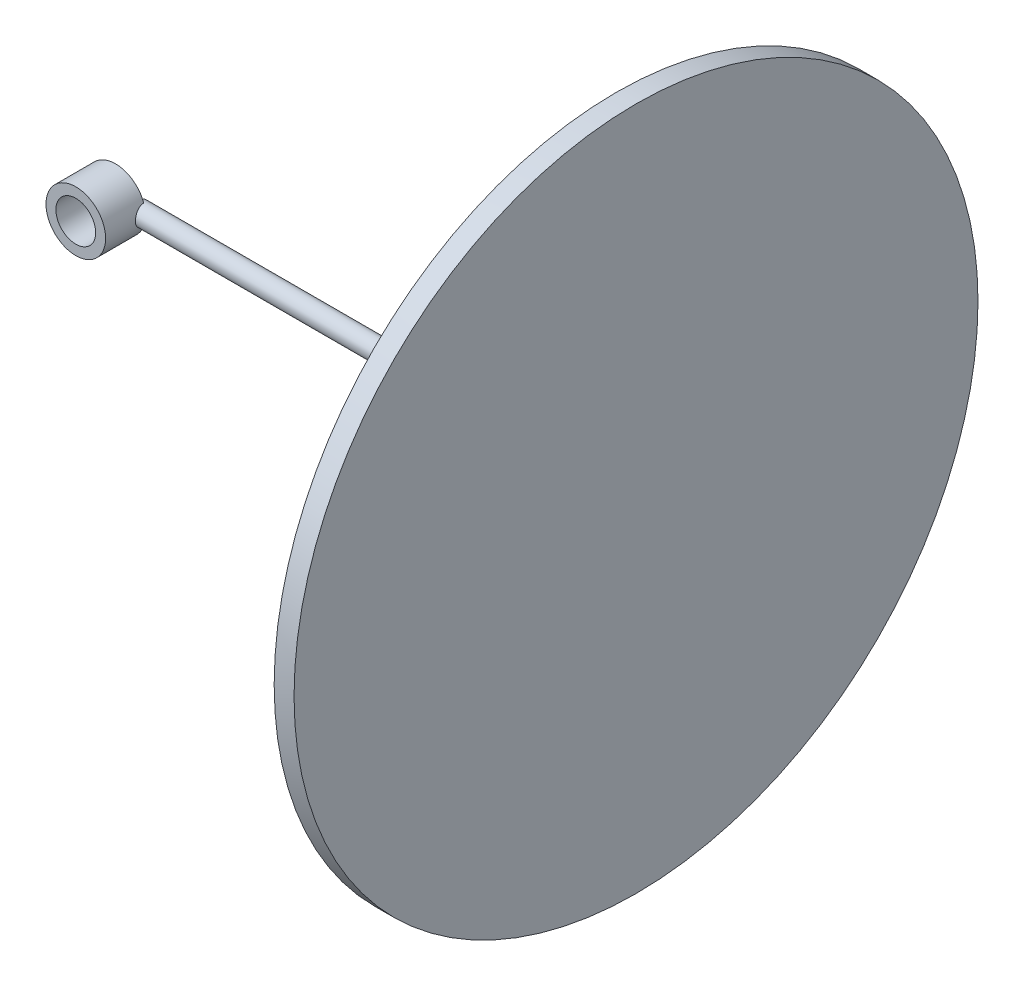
from build123d import *

# Parameters (mm, degrees)
ESQUISSE2_R      = 7.5
ESQUISSE2_R_2    = 5
EXTRUSION1_DEPTH = 10


with BuildPart() as part:
    # Esquisse1 → R_volution1 (revolve)
    with BuildSketch(Plane.XY):
        with BuildLine():
            Line((-88.275873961, 90.704388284), (-88.275873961, 7.204388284))
            Line((-88.275873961, 7.204388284), (-208.275873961, 7.204388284))
            Line((-208.275873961, 7.204388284), (-208.275873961, 4.704388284))
            Line((-208.275873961, 4.704388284), (-83.275873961, 4.704388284))
            Line((-83.275873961, 4.704388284), (-83.275873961, 90.704388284))
            ThreePointArc((-83.275873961, 90.704388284), (-85.775873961, 90.74071782), (-88.275873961, 90.704388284))
        make_face()
    revolve(axis=Axis((-73.84280885, 4.704388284, 0), (-1, 0, 0)))

    # Esquisse2 → Extrusion1 (add)
    with BuildSketch(Plane.XY):
        with Locations(Location((-214.160099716, 4.704388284, 0), (0, 0, 19.471220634))):
            Circle(ESQUISSE2_R)
        with Locations((-214.160099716, 4.704388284)):
            Circle(ESQUISSE2_R_2, mode=Mode.SUBTRACT)
    extrude(amount=EXTRUSION1_DEPTH)


solid = part.part
